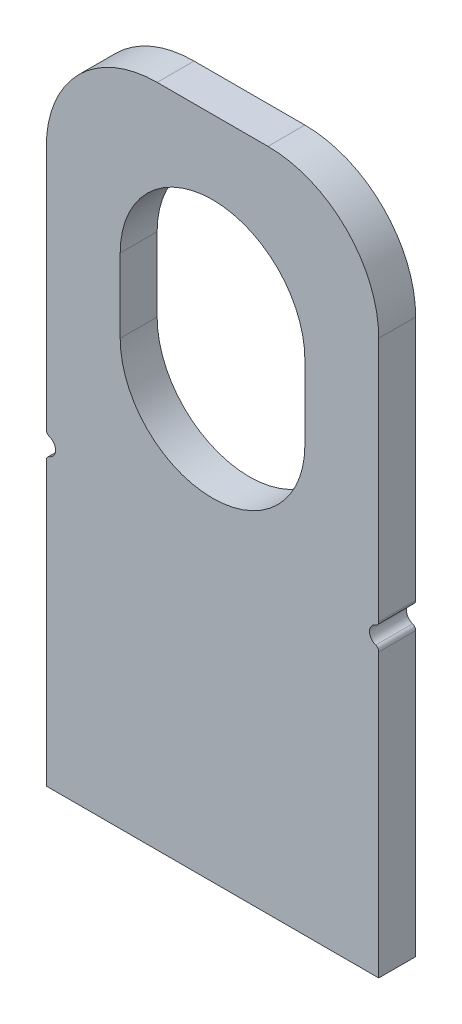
ISO-10303-21;
HEADER;
FILE_DESCRIPTION(('STEP AP214'),'2;1');
FILE_NAME('part.step','',(''),(''),'','','');
FILE_SCHEMA(('AUTOMOTIVE_DESIGN { 1 0 10303 214 1 1 1 1 }'));
ENDSEC;
DATA;
#1=APPLICATION_CONTEXT('core data for automotive mechanical design processes');
#2=APPLICATION_PROTOCOL_DEFINITION('international standard','automotive_design',2000,#1);
#3=PRODUCT_CONTEXT('',#1,'mechanical');
#4=PRODUCT('Part','Part','',(#3));
#5=PRODUCT_RELATED_PRODUCT_CATEGORY('part','',(#4));
#6=PRODUCT_DEFINITION_FORMATION('','',#4);
#7=PRODUCT_DEFINITION_CONTEXT('part definition',#1,'design');
#8=PRODUCT_DEFINITION('design','',#6,#7);
#9=PRODUCT_DEFINITION_SHAPE('','',#8);
#10=(LENGTH_UNIT() NAMED_UNIT(*) SI_UNIT(.MILLI.,.METRE.));
#11=(NAMED_UNIT(*) PLANE_ANGLE_UNIT() SI_UNIT($,.RADIAN.));
#12=(NAMED_UNIT(*) SI_UNIT($,.STERADIAN.) SOLID_ANGLE_UNIT());
#13=UNCERTAINTY_MEASURE_WITH_UNIT(LENGTH_MEASURE(1.E-05),#10,'distance_accuracy_value','');
#14=(GEOMETRIC_REPRESENTATION_CONTEXT(3) GLOBAL_UNCERTAINTY_ASSIGNED_CONTEXT((#13)) GLOBAL_UNIT_ASSIGNED_CONTEXT((#10,
#11,#12)) REPRESENTATION_CONTEXT('',''));
#15=CARTESIAN_POINT('',(0.,0.,0.));
#16=DIRECTION('',(0.,0.,1.));
#17=DIRECTION('',(1.,0.,0.));
#18=AXIS2_PLACEMENT_3D('',#15,#16,#17);
#19=CARTESIAN_POINT('',(55.5624999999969,106.090128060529,12.7));
#20=DIRECTION('',(0.,0.,1.));
#21=DIRECTION('',(1.,0.,0.));
#22=AXIS2_PLACEMENT_3D('',#19,#20,#21);
#23=PLANE('',#22);
#24=CARTESIAN_POINT('',(55.5624999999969,106.090128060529,12.7));
#25=DIRECTION('',(0.,0.,1.));
#26=DIRECTION('',(1.,0.,0.));
#27=AXIS2_PLACEMENT_3D('',#24,#25,#26);
#28=CIRCLE('',#27,1.58749999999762);
#29=CARTESIAN_POINT('',(56.0916666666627,104.593418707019,12.7));
#30=VERTEX_POINT('',#29);
#31=CARTESIAN_POINT('',(57.1499999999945,106.090128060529,12.7));
#32=VERTEX_POINT('',#31);
#33=EDGE_CURVE('E195',#30,#32,#28,.T.);
#34=ORIENTED_EDGE('',*,*,#33,.T.);
#35=DIRECTION('',(0.,1.,0.));
#36=VECTOR('',#35,1.);
#37=CARTESIAN_POINT('',(57.1499999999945,106.090128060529,12.7));
#38=LINE('',#37,#36);
#39=CARTESIAN_POINT('',(57.1499999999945,190.500000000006,12.7));
#40=VERTEX_POINT('',#39);
#41=EDGE_CURVE('E198',#32,#40,#38,.T.);
#42=ORIENTED_EDGE('',*,*,#41,.T.);
#43=CARTESIAN_POINT('',(19.0499999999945,190.500000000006,12.7));
#44=DIRECTION('',(0.,0.,1.));
#45=DIRECTION('',(1.,0.,0.));
#46=AXIS2_PLACEMENT_3D('',#43,#44,#45);
#47=CIRCLE('',#46,38.1);
#48=CARTESIAN_POINT('',(19.0499999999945,228.600000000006,12.7));
#49=VERTEX_POINT('',#48);
#50=EDGE_CURVE('E201',#40,#49,#47,.T.);
#51=ORIENTED_EDGE('',*,*,#50,.T.);
#52=DIRECTION('',(-1.,0.,0.));
#53=VECTOR('',#52,1.);
#54=CARTESIAN_POINT('',(19.0499999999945,228.600000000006,12.7));
#55=LINE('',#54,#53);
#56=CARTESIAN_POINT('',(-19.0499999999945,228.600000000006,12.7));
#57=VERTEX_POINT('',#56);
#58=EDGE_CURVE('E203',#49,#57,#55,.T.);
#59=ORIENTED_EDGE('',*,*,#58,.T.);
#60=CARTESIAN_POINT('',(-19.0499999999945,190.500000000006,12.7));
#61=DIRECTION('',(0.,0.,1.));
#62=DIRECTION('',(1.,0.,0.));
#63=AXIS2_PLACEMENT_3D('',#60,#61,#62);
#64=CIRCLE('',#63,38.1);
#65=CARTESIAN_POINT('',(-57.1499999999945,190.500000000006,12.7));
#66=VERTEX_POINT('',#65);
#67=EDGE_CURVE('E205',#57,#66,#64,.T.);
#68=ORIENTED_EDGE('',*,*,#67,.T.);
#69=DIRECTION('',(0.,-1.,0.));
#70=VECTOR('',#69,1.);
#71=CARTESIAN_POINT('',(-57.1499999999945,190.500000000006,12.7));
#72=LINE('',#71,#70);
#73=CARTESIAN_POINT('',(-57.1499999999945,106.090128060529,12.7));
#74=VERTEX_POINT('',#73);
#75=EDGE_CURVE('E207',#66,#74,#72,.T.);
#76=ORIENTED_EDGE('',*,*,#75,.T.);
#77=CARTESIAN_POINT('',(-55.5624999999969,106.090128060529,12.7));
#78=DIRECTION('',(0.,0.,1.));
#79=DIRECTION('',(1.,0.,0.));
#80=AXIS2_PLACEMENT_3D('',#77,#78,#79);
#81=CIRCLE('',#80,1.58749999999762);
#82=CARTESIAN_POINT('',(-56.0916666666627,104.593418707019,12.7));
#83=VERTEX_POINT('',#82);
#84=EDGE_CURVE('E209',#74,#83,#81,.T.);
#85=ORIENTED_EDGE('',*,*,#84,.T.);
#86=CARTESIAN_POINT('',(-57.1499999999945,101.6,12.7));
#87=DIRECTION('',(0.,0.,-1.));
#88=DIRECTION('',(1.,0.,0.));
#89=AXIS2_PLACEMENT_3D('',#86,#87,#88);
#90=CIRCLE('',#89,3.17499999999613);
#91=CARTESIAN_POINT('',(-56.0916666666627,98.6065812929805,12.7));
#92=VERTEX_POINT('',#91);
#93=EDGE_CURVE('E211',#83,#92,#90,.T.);
#94=ORIENTED_EDGE('',*,*,#93,.T.);
#95=CARTESIAN_POINT('',(-55.5624999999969,97.1098719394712,12.7));
#96=DIRECTION('',(0.,0.,1.));
#97=DIRECTION('',(1.,0.,0.));
#98=AXIS2_PLACEMENT_3D('',#95,#96,#97);
#99=CIRCLE('',#98,1.5874999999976);
#100=CARTESIAN_POINT('',(-57.1499999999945,97.1098719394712,12.7));
#101=VERTEX_POINT('',#100);
#102=EDGE_CURVE('E213',#92,#101,#99,.T.);
#103=ORIENTED_EDGE('',*,*,#102,.T.);
#104=DIRECTION('',(0.,-1.,0.));
#105=VECTOR('',#104,1.);
#106=CARTESIAN_POINT('',(-57.1499999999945,97.1098719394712,12.7));
#107=LINE('',#106,#105);
#108=CARTESIAN_POINT('',(-57.1499999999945,0.,12.7));
#109=VERTEX_POINT('',#108);
#110=EDGE_CURVE('E215',#101,#109,#107,.T.);
#111=ORIENTED_EDGE('',*,*,#110,.T.);
#112=DIRECTION('',(1.,0.,0.));
#113=VECTOR('',#112,1.);
#114=CARTESIAN_POINT('',(-57.1499999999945,0.,12.7));
#115=LINE('',#114,#113);
#116=CARTESIAN_POINT('',(57.1499999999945,0.,12.7));
#117=VERTEX_POINT('',#116);
#118=EDGE_CURVE('E217',#109,#117,#115,.T.);
#119=ORIENTED_EDGE('',*,*,#118,.T.);
#120=DIRECTION('',(0.,1.,0.));
#121=VECTOR('',#120,1.);
#122=CARTESIAN_POINT('',(57.1499999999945,0.,12.7));
#123=LINE('',#122,#121);
#124=CARTESIAN_POINT('',(57.1499999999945,97.1098719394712,12.7));
#125=VERTEX_POINT('',#124);
#126=EDGE_CURVE('E219',#117,#125,#123,.T.);
#127=ORIENTED_EDGE('',*,*,#126,.T.);
#128=CARTESIAN_POINT('',(55.5624999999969,97.1098719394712,12.7));
#129=DIRECTION('',(0.,0.,1.));
#130=DIRECTION('',(1.,0.,0.));
#131=AXIS2_PLACEMENT_3D('',#128,#129,#130);
#132=CIRCLE('',#131,1.5874999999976);
#133=CARTESIAN_POINT('',(56.0916666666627,98.6065812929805,12.7));
#134=VERTEX_POINT('',#133);
#135=EDGE_CURVE('E221',#125,#134,#132,.T.);
#136=ORIENTED_EDGE('',*,*,#135,.T.);
#137=CARTESIAN_POINT('',(57.1499999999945,101.6,12.7));
#138=DIRECTION('',(0.,0.,-1.));
#139=DIRECTION('',(1.,0.,0.));
#140=AXIS2_PLACEMENT_3D('',#137,#138,#139);
#141=CIRCLE('',#140,3.17499999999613);
#142=EDGE_CURVE('E223',#134,#30,#141,.T.);
#143=ORIENTED_EDGE('',*,*,#142,.T.);
#144=EDGE_LOOP('',(#34,#42,#51,#59,#68,#76,#85,#94,#103,#111,#119,#127,#136,#143));
#145=FACE_BOUND('',#144,.T.);
#146=DIRECTION('',(0.,1.,0.));
#147=VECTOR('',#146,1.);
#148=CARTESIAN_POINT('',(31.75,146.05,12.7));
#149=LINE('',#148,#147);
#150=CARTESIAN_POINT('',(31.75,146.05,12.7));
#151=VERTEX_POINT('',#150);
#152=CARTESIAN_POINT('',(31.75,171.45,12.7));
#153=VERTEX_POINT('',#152);
#154=EDGE_CURVE('E167',#151,#153,#149,.T.);
#155=ORIENTED_EDGE('',*,*,#154,.F.);
#156=CARTESIAN_POINT('',(0.,146.05,12.7));
#157=DIRECTION('',(0.,0.,1.));
#158=DIRECTION('',(1.,0.,0.));
#159=AXIS2_PLACEMENT_3D('',#156,#157,#158);
#160=CIRCLE('',#159,31.75);
#161=CARTESIAN_POINT('',(-31.75,146.05,12.7));
#162=VERTEX_POINT('',#161);
#163=EDGE_CURVE('E159',#162,#151,#160,.T.);
#164=ORIENTED_EDGE('',*,*,#163,.F.);
#165=DIRECTION('',(0.,-1.,0.));
#166=VECTOR('',#165,1.);
#167=CARTESIAN_POINT('',(-31.75,146.05,12.7));
#168=LINE('',#167,#166);
#169=CARTESIAN_POINT('',(-31.75,171.45,12.7));
#170=VERTEX_POINT('',#169);
#171=EDGE_CURVE('E181',#170,#162,#168,.T.);
#172=ORIENTED_EDGE('',*,*,#171,.F.);
#173=CARTESIAN_POINT('',(0.,171.45,12.7));
#174=DIRECTION('',(0.,0.,1.));
#175=DIRECTION('',(1.,0.,0.));
#176=AXIS2_PLACEMENT_3D('',#173,#174,#175);
#177=CIRCLE('',#176,31.75);
#178=EDGE_CURVE('E179',#153,#170,#177,.T.);
#179=ORIENTED_EDGE('',*,*,#178,.F.);
#180=EDGE_LOOP('',(#155,#164,#172,#179));
#181=FACE_BOUND('',#180,.T.);
#182=ADVANCED_FACE('F34',(#145,#181),#23,.T.);
#183=CARTESIAN_POINT('',(55.5624999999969,106.090128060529,0.));
#184=DIRECTION('',(0.,0.,1.));
#185=DIRECTION('',(1.,0.,0.));
#186=AXIS2_PLACEMENT_3D('',#183,#184,#185);
#187=PLANE('',#186);
#188=CARTESIAN_POINT('',(55.5624999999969,106.090128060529,0.));
#189=DIRECTION('',(0.,0.,1.));
#190=DIRECTION('',(1.,0.,0.));
#191=AXIS2_PLACEMENT_3D('',#188,#189,#190);
#192=CIRCLE('',#191,1.58749999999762);
#193=CARTESIAN_POINT('',(56.0916666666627,104.593418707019,0.));
#194=VERTEX_POINT('',#193);
#195=CARTESIAN_POINT('',(57.1499999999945,106.090128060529,0.));
#196=VERTEX_POINT('',#195);
#197=EDGE_CURVE('E175',#194,#196,#192,.T.);
#198=ORIENTED_EDGE('',*,*,#197,.F.);
#199=CARTESIAN_POINT('',(57.1499999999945,101.6,0.));
#200=DIRECTION('',(0.,0.,-1.));
#201=DIRECTION('',(1.,0.,0.));
#202=AXIS2_PLACEMENT_3D('',#199,#200,#201);
#203=CIRCLE('',#202,3.17499999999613);
#204=CARTESIAN_POINT('',(56.0916666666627,98.6065812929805,0.));
#205=VERTEX_POINT('',#204);
#206=EDGE_CURVE('E199',#205,#194,#203,.T.);
#207=ORIENTED_EDGE('',*,*,#206,.F.);
#208=CARTESIAN_POINT('',(55.5624999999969,97.1098719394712,0.));
#209=DIRECTION('',(0.,0.,1.));
#210=DIRECTION('',(1.,0.,0.));
#211=AXIS2_PLACEMENT_3D('',#208,#209,#210);
#212=CIRCLE('',#211,1.5874999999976);
#213=CARTESIAN_POINT('',(57.1499999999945,97.1098719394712,0.));
#214=VERTEX_POINT('',#213);
#215=EDGE_CURVE('E250',#214,#205,#212,.T.);
#216=ORIENTED_EDGE('',*,*,#215,.F.);
#217=DIRECTION('',(0.,1.,0.));
#218=VECTOR('',#217,1.);
#219=CARTESIAN_POINT('',(57.1499999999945,0.,0.));
#220=LINE('',#219,#218);
#221=CARTESIAN_POINT('',(57.1499999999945,0.,0.));
#222=VERTEX_POINT('',#221);
#223=EDGE_CURVE('E248',#222,#214,#220,.T.);
#224=ORIENTED_EDGE('',*,*,#223,.F.);
#225=DIRECTION('',(1.,0.,0.));
#226=VECTOR('',#225,1.);
#227=CARTESIAN_POINT('',(-57.1499999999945,0.,0.));
#228=LINE('',#227,#226);
#229=CARTESIAN_POINT('',(-57.1499999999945,0.,0.));
#230=VERTEX_POINT('',#229);
#231=EDGE_CURVE('E246',#230,#222,#228,.T.);
#232=ORIENTED_EDGE('',*,*,#231,.F.);
#233=DIRECTION('',(0.,-1.,0.));
#234=VECTOR('',#233,1.);
#235=CARTESIAN_POINT('',(-57.1499999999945,97.1098719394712,0.));
#236=LINE('',#235,#234);
#237=CARTESIAN_POINT('',(-57.1499999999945,97.1098719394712,0.));
#238=VERTEX_POINT('',#237);
#239=EDGE_CURVE('E244',#238,#230,#236,.T.);
#240=ORIENTED_EDGE('',*,*,#239,.F.);
#241=CARTESIAN_POINT('',(-55.5624999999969,97.1098719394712,0.));
#242=DIRECTION('',(0.,0.,1.));
#243=DIRECTION('',(1.,0.,0.));
#244=AXIS2_PLACEMENT_3D('',#241,#242,#243);
#245=CIRCLE('',#244,1.5874999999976);
#246=CARTESIAN_POINT('',(-56.0916666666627,98.6065812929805,0.));
#247=VERTEX_POINT('',#246);
#248=EDGE_CURVE('E242',#247,#238,#245,.T.);
#249=ORIENTED_EDGE('',*,*,#248,.F.);
#250=CARTESIAN_POINT('',(-57.1499999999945,101.6,0.));
#251=DIRECTION('',(0.,0.,-1.));
#252=DIRECTION('',(1.,0.,0.));
#253=AXIS2_PLACEMENT_3D('',#250,#251,#252);
#254=CIRCLE('',#253,3.17499999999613);
#255=CARTESIAN_POINT('',(-56.0916666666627,104.593418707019,0.));
#256=VERTEX_POINT('',#255);
#257=EDGE_CURVE('E240',#256,#247,#254,.T.);
#258=ORIENTED_EDGE('',*,*,#257,.F.);
#259=CARTESIAN_POINT('',(-55.5624999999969,106.090128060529,0.));
#260=DIRECTION('',(0.,0.,1.));
#261=DIRECTION('',(1.,0.,0.));
#262=AXIS2_PLACEMENT_3D('',#259,#260,#261);
#263=CIRCLE('',#262,1.58749999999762);
#264=CARTESIAN_POINT('',(-57.1499999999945,106.090128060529,0.));
#265=VERTEX_POINT('',#264);
#266=EDGE_CURVE('E238',#265,#256,#263,.T.);
#267=ORIENTED_EDGE('',*,*,#266,.F.);
#268=DIRECTION('',(0.,-1.,0.));
#269=VECTOR('',#268,1.);
#270=CARTESIAN_POINT('',(-57.1499999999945,190.500000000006,0.));
#271=LINE('',#270,#269);
#272=CARTESIAN_POINT('',(-57.1499999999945,190.500000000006,0.));
#273=VERTEX_POINT('',#272);
#274=EDGE_CURVE('E236',#273,#265,#271,.T.);
#275=ORIENTED_EDGE('',*,*,#274,.F.);
#276=CARTESIAN_POINT('',(-19.0499999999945,190.500000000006,0.));
#277=DIRECTION('',(0.,0.,1.));
#278=DIRECTION('',(1.,0.,0.));
#279=AXIS2_PLACEMENT_3D('',#276,#277,#278);
#280=CIRCLE('',#279,38.1);
#281=CARTESIAN_POINT('',(-19.0499999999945,228.600000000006,0.));
#282=VERTEX_POINT('',#281);
#283=EDGE_CURVE('E234',#282,#273,#280,.T.);
#284=ORIENTED_EDGE('',*,*,#283,.F.);
#285=DIRECTION('',(-1.,0.,0.));
#286=VECTOR('',#285,1.);
#287=CARTESIAN_POINT('',(19.0499999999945,228.600000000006,0.));
#288=LINE('',#287,#286);
#289=CARTESIAN_POINT('',(19.0499999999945,228.600000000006,0.));
#290=VERTEX_POINT('',#289);
#291=EDGE_CURVE('E232',#290,#282,#288,.T.);
#292=ORIENTED_EDGE('',*,*,#291,.F.);
#293=CARTESIAN_POINT('',(19.0499999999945,190.500000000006,0.));
#294=DIRECTION('',(0.,0.,1.));
#295=DIRECTION('',(1.,0.,0.));
#296=AXIS2_PLACEMENT_3D('',#293,#294,#295);
#297=CIRCLE('',#296,38.1);
#298=CARTESIAN_POINT('',(57.1499999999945,190.500000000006,0.));
#299=VERTEX_POINT('',#298);
#300=EDGE_CURVE('E230',#299,#290,#297,.T.);
#301=ORIENTED_EDGE('',*,*,#300,.F.);
#302=DIRECTION('',(0.,1.,0.));
#303=VECTOR('',#302,1.);
#304=CARTESIAN_POINT('',(57.1499999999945,106.090128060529,0.));
#305=LINE('',#304,#303);
#306=EDGE_CURVE('E228',#196,#299,#305,.T.);
#307=ORIENTED_EDGE('',*,*,#306,.F.);
#308=EDGE_LOOP('',(#198,#207,#216,#224,#232,#240,#249,#258,#267,#275,#284,#292,#301,#307));
#309=FACE_BOUND('',#308,.T.);
#310=CARTESIAN_POINT('',(0.,146.05,0.));
#311=DIRECTION('',(0.,0.,1.));
#312=DIRECTION('',(1.,0.,0.));
#313=AXIS2_PLACEMENT_3D('',#310,#311,#312);
#314=CIRCLE('',#313,31.75);
#315=CARTESIAN_POINT('',(-31.75,146.05,0.));
#316=VERTEX_POINT('',#315);
#317=CARTESIAN_POINT('',(31.75,146.05,0.));
#318=VERTEX_POINT('',#317);
#319=EDGE_CURVE('E57',#316,#318,#314,.T.);
#320=ORIENTED_EDGE('',*,*,#319,.T.);
#321=DIRECTION('',(0.,1.,0.));
#322=VECTOR('',#321,1.);
#323=CARTESIAN_POINT('',(31.75,146.05,0.));
#324=LINE('',#323,#322);
#325=CARTESIAN_POINT('',(31.75,171.45,0.));
#326=VERTEX_POINT('',#325);
#327=EDGE_CURVE('E174',#318,#326,#324,.T.);
#328=ORIENTED_EDGE('',*,*,#327,.T.);
#329=CARTESIAN_POINT('',(0.,171.45,0.));
#330=DIRECTION('',(0.,0.,1.));
#331=DIRECTION('',(1.,0.,0.));
#332=AXIS2_PLACEMENT_3D('',#329,#330,#331);
#333=CIRCLE('',#332,31.75);
#334=CARTESIAN_POINT('',(-31.75,171.45,0.));
#335=VERTEX_POINT('',#334);
#336=EDGE_CURVE('E187',#326,#335,#333,.T.);
#337=ORIENTED_EDGE('',*,*,#336,.T.);
#338=DIRECTION('',(0.,-1.,0.));
#339=VECTOR('',#338,1.);
#340=CARTESIAN_POINT('',(-31.75,146.05,0.));
#341=LINE('',#340,#339);
#342=EDGE_CURVE('E168',#335,#316,#341,.T.);
#343=ORIENTED_EDGE('',*,*,#342,.T.);
#344=EDGE_LOOP('',(#320,#328,#337,#343));
#345=FACE_BOUND('',#344,.T.);
#346=ADVANCED_FACE('F298',(#309,#345),#187,.F.);
#347=CARTESIAN_POINT('',(55.5624999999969,106.090128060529,12.7));
#348=DIRECTION('',(0.,0.,-1.));
#349=DIRECTION('',(-1.,0.,0.));
#350=AXIS2_PLACEMENT_3D('',#347,#348,#349);
#351=CYLINDRICAL_SURFACE('',#350,1.58749999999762);
#352=ORIENTED_EDGE('',*,*,#197,.T.);
#353=DIRECTION('',(0.,0.,-1.));
#354=VECTOR('',#353,1.);
#355=CARTESIAN_POINT('',(57.1499999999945,106.090128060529,12.7));
#356=LINE('',#355,#354);
#357=EDGE_CURVE('E11',#32,#196,#356,.T.);
#358=ORIENTED_EDGE('',*,*,#357,.F.);
#359=ORIENTED_EDGE('',*,*,#33,.F.);
#360=DIRECTION('',(0.,0.,-1.));
#361=VECTOR('',#360,1.);
#362=CARTESIAN_POINT('',(56.0916666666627,104.593418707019,12.7));
#363=LINE('',#362,#361);
#364=EDGE_CURVE('E225',#30,#194,#363,.T.);
#365=ORIENTED_EDGE('',*,*,#364,.T.);
#366=EDGE_LOOP('',(#352,#358,#359,#365));
#367=FACE_BOUND('',#366,.T.);
#368=ADVANCED_FACE('F36',(#367),#351,.T.);
#369=CARTESIAN_POINT('',(57.1499999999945,106.090128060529,12.7));
#370=DIRECTION('',(-1.,0.,0.));
#371=DIRECTION('',(0.,-1.,0.));
#372=AXIS2_PLACEMENT_3D('',#369,#370,#371);
#373=PLANE('',#372);
#374=ORIENTED_EDGE('',*,*,#306,.T.);
#375=DIRECTION('',(0.,0.,-1.));
#376=VECTOR('',#375,1.);
#377=CARTESIAN_POINT('',(57.1499999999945,190.500000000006,12.7));
#378=LINE('',#377,#376);
#379=EDGE_CURVE('E42',#40,#299,#378,.T.);
#380=ORIENTED_EDGE('',*,*,#379,.F.);
#381=ORIENTED_EDGE('',*,*,#41,.F.);
#382=ORIENTED_EDGE('',*,*,#357,.T.);
#383=EDGE_LOOP('',(#374,#380,#381,#382));
#384=FACE_BOUND('',#383,.T.);
#385=ADVANCED_FACE('F315',(#384),#373,.F.);
#386=CARTESIAN_POINT('',(19.0499999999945,190.500000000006,12.7));
#387=DIRECTION('',(0.,0.,-1.));
#388=DIRECTION('',(-1.,0.,0.));
#389=AXIS2_PLACEMENT_3D('',#386,#387,#388);
#390=CYLINDRICAL_SURFACE('',#389,38.1);
#391=ORIENTED_EDGE('',*,*,#300,.T.);
#392=DIRECTION('',(0.,0.,-1.));
#393=VECTOR('',#392,1.);
#394=CARTESIAN_POINT('',(19.0499999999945,228.600000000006,12.7));
#395=LINE('',#394,#393);
#396=EDGE_CURVE('E285',#49,#290,#395,.T.);
#397=ORIENTED_EDGE('',*,*,#396,.F.);
#398=ORIENTED_EDGE('',*,*,#50,.F.);
#399=ORIENTED_EDGE('',*,*,#379,.T.);
#400=EDGE_LOOP('',(#391,#397,#398,#399));
#401=FACE_BOUND('',#400,.T.);
#402=ADVANCED_FACE('F292',(#401),#390,.T.);
#403=CARTESIAN_POINT('',(19.0499999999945,228.600000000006,12.7));
#404=DIRECTION('',(0.,-1.,0.));
#405=DIRECTION('',(0.,0.,-1.));
#406=AXIS2_PLACEMENT_3D('',#403,#404,#405);
#407=PLANE('',#406);
#408=ORIENTED_EDGE('',*,*,#291,.T.);
#409=DIRECTION('',(0.,0.,-1.));
#410=VECTOR('',#409,1.);
#411=CARTESIAN_POINT('',(-19.0499999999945,228.600000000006,12.7));
#412=LINE('',#411,#410);
#413=EDGE_CURVE('E282',#57,#282,#412,.T.);
#414=ORIENTED_EDGE('',*,*,#413,.F.);
#415=ORIENTED_EDGE('',*,*,#58,.F.);
#416=ORIENTED_EDGE('',*,*,#396,.T.);
#417=EDGE_LOOP('',(#408,#414,#415,#416));
#418=FACE_BOUND('',#417,.T.);
#419=ADVANCED_FACE('F304',(#418),#407,.F.);
#420=CARTESIAN_POINT('',(-19.0499999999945,190.500000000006,12.7));
#421=DIRECTION('',(0.,0.,-1.));
#422=DIRECTION('',(-1.,0.,0.));
#423=AXIS2_PLACEMENT_3D('',#420,#421,#422);
#424=CYLINDRICAL_SURFACE('',#423,38.1);
#425=ORIENTED_EDGE('',*,*,#283,.T.);
#426=DIRECTION('',(0.,0.,-1.));
#427=VECTOR('',#426,1.);
#428=CARTESIAN_POINT('',(-57.1499999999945,190.500000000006,12.7));
#429=LINE('',#428,#427);
#430=EDGE_CURVE('E279',#66,#273,#429,.T.);
#431=ORIENTED_EDGE('',*,*,#430,.F.);
#432=ORIENTED_EDGE('',*,*,#67,.F.);
#433=ORIENTED_EDGE('',*,*,#413,.T.);
#434=EDGE_LOOP('',(#425,#431,#432,#433));
#435=FACE_BOUND('',#434,.T.);
#436=ADVANCED_FACE('F308',(#435),#424,.T.);
#437=CARTESIAN_POINT('',(-57.1499999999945,190.500000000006,12.7));
#438=DIRECTION('',(1.,0.,0.));
#439=DIRECTION('',(0.,1.,0.));
#440=AXIS2_PLACEMENT_3D('',#437,#438,#439);
#441=PLANE('',#440);
#442=ORIENTED_EDGE('',*,*,#274,.T.);
#443=DIRECTION('',(0.,0.,-1.));
#444=VECTOR('',#443,1.);
#445=CARTESIAN_POINT('',(-57.1499999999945,106.090128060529,12.7));
#446=LINE('',#445,#444);
#447=EDGE_CURVE('E276',#74,#265,#446,.T.);
#448=ORIENTED_EDGE('',*,*,#447,.F.);
#449=ORIENTED_EDGE('',*,*,#75,.F.);
#450=ORIENTED_EDGE('',*,*,#430,.T.);
#451=EDGE_LOOP('',(#442,#448,#449,#450));
#452=FACE_BOUND('',#451,.T.);
#453=ADVANCED_FACE('F358',(#452),#441,.F.);
#454=CARTESIAN_POINT('',(-55.5624999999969,106.090128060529,12.7));
#455=DIRECTION('',(0.,0.,-1.));
#456=DIRECTION('',(-1.,0.,0.));
#457=AXIS2_PLACEMENT_3D('',#454,#455,#456);
#458=CYLINDRICAL_SURFACE('',#457,1.58749999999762);
#459=ORIENTED_EDGE('',*,*,#266,.T.);
#460=DIRECTION('',(0.,0.,-1.));
#461=VECTOR('',#460,1.);
#462=CARTESIAN_POINT('',(-56.0916666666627,104.593418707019,12.7));
#463=LINE('',#462,#461);
#464=EDGE_CURVE('E273',#83,#256,#463,.T.);
#465=ORIENTED_EDGE('',*,*,#464,.F.);
#466=ORIENTED_EDGE('',*,*,#84,.F.);
#467=ORIENTED_EDGE('',*,*,#447,.T.);
#468=EDGE_LOOP('',(#459,#465,#466,#467));
#469=FACE_BOUND('',#468,.T.);
#470=ADVANCED_FACE('F356',(#469),#458,.T.);
#471=CARTESIAN_POINT('',(-57.1499999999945,101.6,12.7));
#472=DIRECTION('',(0.,0.,-1.));
#473=DIRECTION('',(-1.,0.,0.));
#474=AXIS2_PLACEMENT_3D('',#471,#472,#473);
#475=CYLINDRICAL_SURFACE('',#474,3.17499999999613);
#476=ORIENTED_EDGE('',*,*,#257,.T.);
#477=DIRECTION('',(0.,0.,-1.));
#478=VECTOR('',#477,1.);
#479=CARTESIAN_POINT('',(-56.0916666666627,98.6065812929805,12.7));
#480=LINE('',#479,#478);
#481=EDGE_CURVE('E270',#92,#247,#480,.T.);
#482=ORIENTED_EDGE('',*,*,#481,.F.);
#483=ORIENTED_EDGE('',*,*,#93,.F.);
#484=ORIENTED_EDGE('',*,*,#464,.T.);
#485=EDGE_LOOP('',(#476,#482,#483,#484));
#486=FACE_BOUND('',#485,.T.);
#487=ADVANCED_FACE('F351',(#486),#475,.F.);
#488=CARTESIAN_POINT('',(-55.5624999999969,97.1098719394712,12.7));
#489=DIRECTION('',(0.,0.,-1.));
#490=DIRECTION('',(-1.,0.,0.));
#491=AXIS2_PLACEMENT_3D('',#488,#489,#490);
#492=CYLINDRICAL_SURFACE('',#491,1.5874999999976);
#493=ORIENTED_EDGE('',*,*,#248,.T.);
#494=DIRECTION('',(0.,0.,-1.));
#495=VECTOR('',#494,1.);
#496=CARTESIAN_POINT('',(-57.1499999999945,97.1098719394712,12.7));
#497=LINE('',#496,#495);
#498=EDGE_CURVE('E267',#101,#238,#497,.T.);
#499=ORIENTED_EDGE('',*,*,#498,.F.);
#500=ORIENTED_EDGE('',*,*,#102,.F.);
#501=ORIENTED_EDGE('',*,*,#481,.T.);
#502=EDGE_LOOP('',(#493,#499,#500,#501));
#503=FACE_BOUND('',#502,.T.);
#504=ADVANCED_FACE('F346',(#503),#492,.T.);
#505=CARTESIAN_POINT('',(-57.1499999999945,97.1098719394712,12.7));
#506=DIRECTION('',(1.,0.,0.));
#507=DIRECTION('',(0.,1.,0.));
#508=AXIS2_PLACEMENT_3D('',#505,#506,#507);
#509=PLANE('',#508);
#510=ORIENTED_EDGE('',*,*,#239,.T.);
#511=DIRECTION('',(0.,0.,-1.));
#512=VECTOR('',#511,1.);
#513=CARTESIAN_POINT('',(-57.1499999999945,0.,12.7));
#514=LINE('',#513,#512);
#515=EDGE_CURVE('E264',#109,#230,#514,.T.);
#516=ORIENTED_EDGE('',*,*,#515,.F.);
#517=ORIENTED_EDGE('',*,*,#110,.F.);
#518=ORIENTED_EDGE('',*,*,#498,.T.);
#519=EDGE_LOOP('',(#510,#516,#517,#518));
#520=FACE_BOUND('',#519,.T.);
#521=ADVANCED_FACE('F342',(#520),#509,.F.);
#522=CARTESIAN_POINT('',(-57.1499999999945,0.,12.7));
#523=DIRECTION('',(0.,1.,0.));
#524=DIRECTION('',(-1.,0.,0.));
#525=AXIS2_PLACEMENT_3D('',#522,#523,#524);
#526=PLANE('',#525);
#527=ORIENTED_EDGE('',*,*,#231,.T.);
#528=DIRECTION('',(0.,0.,-1.));
#529=VECTOR('',#528,1.);
#530=CARTESIAN_POINT('',(57.1499999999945,0.,12.7));
#531=LINE('',#530,#529);
#532=EDGE_CURVE('E261',#117,#222,#531,.T.);
#533=ORIENTED_EDGE('',*,*,#532,.F.);
#534=ORIENTED_EDGE('',*,*,#118,.F.);
#535=ORIENTED_EDGE('',*,*,#515,.T.);
#536=EDGE_LOOP('',(#527,#533,#534,#535));
#537=FACE_BOUND('',#536,.T.);
#538=ADVANCED_FACE('F337',(#537),#526,.F.);
#539=CARTESIAN_POINT('',(57.1499999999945,0.,12.7));
#540=DIRECTION('',(-1.,0.,0.));
#541=DIRECTION('',(0.,-1.,0.));
#542=AXIS2_PLACEMENT_3D('',#539,#540,#541);
#543=PLANE('',#542);
#544=ORIENTED_EDGE('',*,*,#223,.T.);
#545=DIRECTION('',(0.,0.,-1.));
#546=VECTOR('',#545,1.);
#547=CARTESIAN_POINT('',(57.1499999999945,97.1098719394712,12.7));
#548=LINE('',#547,#546);
#549=EDGE_CURVE('E258',#125,#214,#548,.T.);
#550=ORIENTED_EDGE('',*,*,#549,.F.);
#551=ORIENTED_EDGE('',*,*,#126,.F.);
#552=ORIENTED_EDGE('',*,*,#532,.T.);
#553=EDGE_LOOP('',(#544,#550,#551,#552));
#554=FACE_BOUND('',#553,.T.);
#555=ADVANCED_FACE('F331',(#554),#543,.F.);
#556=CARTESIAN_POINT('',(55.5624999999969,97.1098719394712,12.7));
#557=DIRECTION('',(0.,0.,-1.));
#558=DIRECTION('',(-1.,0.,0.));
#559=AXIS2_PLACEMENT_3D('',#556,#557,#558);
#560=CYLINDRICAL_SURFACE('',#559,1.5874999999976);
#561=ORIENTED_EDGE('',*,*,#215,.T.);
#562=DIRECTION('',(0.,0.,-1.));
#563=VECTOR('',#562,1.);
#564=CARTESIAN_POINT('',(56.0916666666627,98.6065812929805,12.7));
#565=LINE('',#564,#563);
#566=EDGE_CURVE('E255',#134,#205,#565,.T.);
#567=ORIENTED_EDGE('',*,*,#566,.F.);
#568=ORIENTED_EDGE('',*,*,#135,.F.);
#569=ORIENTED_EDGE('',*,*,#549,.T.);
#570=EDGE_LOOP('',(#561,#567,#568,#569));
#571=FACE_BOUND('',#570,.T.);
#572=ADVANCED_FACE('F327',(#571),#560,.T.);
#573=CARTESIAN_POINT('',(57.1499999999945,101.6,12.7));
#574=DIRECTION('',(0.,0.,-1.));
#575=DIRECTION('',(-1.,0.,0.));
#576=AXIS2_PLACEMENT_3D('',#573,#574,#575);
#577=CYLINDRICAL_SURFACE('',#576,3.17499999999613);
#578=ORIENTED_EDGE('',*,*,#206,.T.);
#579=ORIENTED_EDGE('',*,*,#364,.F.);
#580=ORIENTED_EDGE('',*,*,#142,.F.);
#581=ORIENTED_EDGE('',*,*,#566,.T.);
#582=EDGE_LOOP('',(#578,#579,#580,#581));
#583=FACE_BOUND('',#582,.T.);
#584=ADVANCED_FACE('F322',(#583),#577,.F.);
#585=CARTESIAN_POINT('',(0.,146.05,12.7));
#586=DIRECTION('',(0.,0.,-1.));
#587=DIRECTION('',(-1.,0.,0.));
#588=AXIS2_PLACEMENT_3D('',#585,#586,#587);
#589=CYLINDRICAL_SURFACE('',#588,31.75);
#590=ORIENTED_EDGE('',*,*,#319,.F.);
#591=DIRECTION('',(0.,0.,-1.));
#592=VECTOR('',#591,1.);
#593=CARTESIAN_POINT('',(-31.75,146.05,12.7));
#594=LINE('',#593,#592);
#595=EDGE_CURVE('E163',#162,#316,#594,.T.);
#596=ORIENTED_EDGE('',*,*,#595,.F.);
#597=ORIENTED_EDGE('',*,*,#163,.T.);
#598=DIRECTION('',(0.,0.,-1.));
#599=VECTOR('',#598,1.);
#600=CARTESIAN_POINT('',(31.75,146.05,12.7));
#601=LINE('',#600,#599);
#602=EDGE_CURVE('E162',#151,#318,#601,.T.);
#603=ORIENTED_EDGE('',*,*,#602,.T.);
#604=EDGE_LOOP('',(#590,#596,#597,#603));
#605=FACE_BOUND('',#604,.T.);
#606=ADVANCED_FACE('F161',(#605),#589,.F.);
#607=CARTESIAN_POINT('',(31.75,146.05,12.7));
#608=DIRECTION('',(-1.,0.,0.));
#609=DIRECTION('',(0.,-1.,0.));
#610=AXIS2_PLACEMENT_3D('',#607,#608,#609);
#611=PLANE('',#610);
#612=ORIENTED_EDGE('',*,*,#327,.F.);
#613=ORIENTED_EDGE('',*,*,#602,.F.);
#614=ORIENTED_EDGE('',*,*,#154,.T.);
#615=DIRECTION('',(0.,0.,-1.));
#616=VECTOR('',#615,1.);
#617=CARTESIAN_POINT('',(31.75,171.45,12.7));
#618=LINE('',#617,#616);
#619=EDGE_CURVE('E176',#153,#326,#618,.T.);
#620=ORIENTED_EDGE('',*,*,#619,.T.);
#621=EDGE_LOOP('',(#612,#613,#614,#620));
#622=FACE_BOUND('',#621,.T.);
#623=ADVANCED_FACE('F171',(#622),#611,.T.);
#624=CARTESIAN_POINT('',(0.,171.45,12.7));
#625=DIRECTION('',(0.,0.,-1.));
#626=DIRECTION('',(-1.,0.,0.));
#627=AXIS2_PLACEMENT_3D('',#624,#625,#626);
#628=CYLINDRICAL_SURFACE('',#627,31.75);
#629=ORIENTED_EDGE('',*,*,#336,.F.);
#630=ORIENTED_EDGE('',*,*,#619,.F.);
#631=ORIENTED_EDGE('',*,*,#178,.T.);
#632=DIRECTION('',(0.,0.,-1.));
#633=VECTOR('',#632,1.);
#634=CARTESIAN_POINT('',(-31.75,171.45,12.7));
#635=LINE('',#634,#633);
#636=EDGE_CURVE('E49',#170,#335,#635,.T.);
#637=ORIENTED_EDGE('',*,*,#636,.T.);
#638=EDGE_LOOP('',(#629,#630,#631,#637));
#639=FACE_BOUND('',#638,.T.);
#640=ADVANCED_FACE('F428',(#639),#628,.F.);
#641=CARTESIAN_POINT('',(-31.75,146.05,12.7));
#642=DIRECTION('',(1.,0.,0.));
#643=DIRECTION('',(0.,1.,0.));
#644=AXIS2_PLACEMENT_3D('',#641,#642,#643);
#645=PLANE('',#644);
#646=ORIENTED_EDGE('',*,*,#342,.F.);
#647=ORIENTED_EDGE('',*,*,#636,.F.);
#648=ORIENTED_EDGE('',*,*,#171,.T.);
#649=ORIENTED_EDGE('',*,*,#595,.T.);
#650=EDGE_LOOP('',(#646,#647,#648,#649));
#651=FACE_BOUND('',#650,.T.);
#652=ADVANCED_FACE('F434',(#651),#645,.T.);
#653=CLOSED_SHELL('',(#182,#346,#368,#385,#402,#419,#436,#453,#470,#487,#504,#521,#538,#555,
#572,#584,#606,#623,#640,#652));
#654=MANIFOLD_SOLID_BREP('B2',#653);
#655=ADVANCED_BREP_SHAPE_REPRESENTATION('',(#18,#654),#14);
#656=SHAPE_DEFINITION_REPRESENTATION(#9,#655);
ENDSEC;
END-ISO-10303-21;
